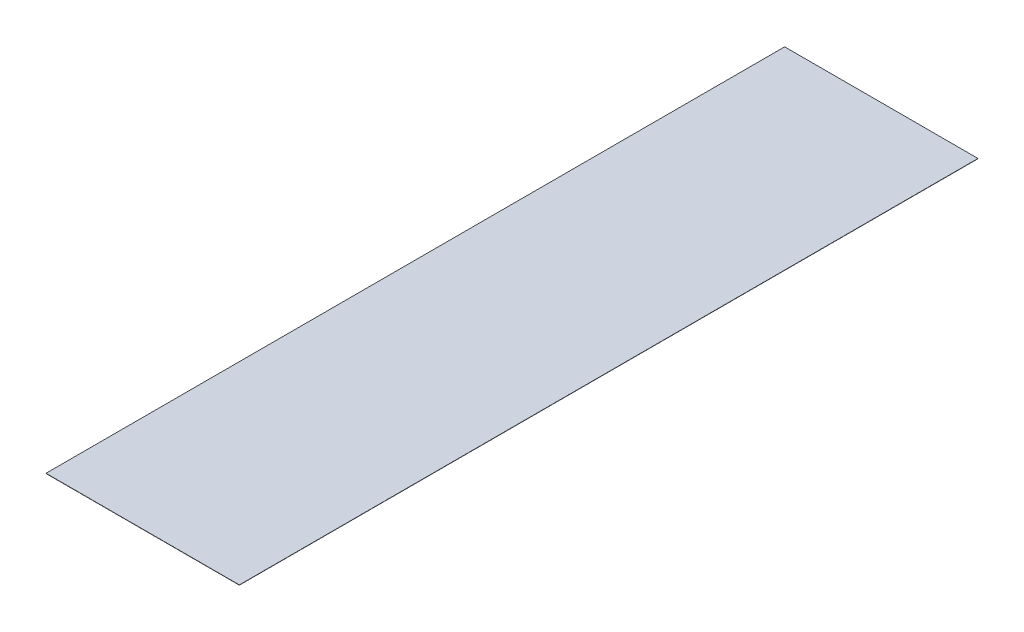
from build123d import *

# Parameters (mm, degrees)
SKETCH1_W      = 6.35
SKETCH1_H      = 24.257
EXTRUDE1_DEPTH = 0.0079


with BuildPart() as part:
    # Sketch1 → Extrude1 (new body)
    with BuildSketch(Plane(origin=(0, 0, 0), x_dir=(1, 0, 0), z_dir=(0, 1, 0))):
        with Locations((-0.12848107, 0)):
            Rectangle(SKETCH1_W, SKETCH1_H)
    extrude(amount=EXTRUDE1_DEPTH)


solid = part.part
